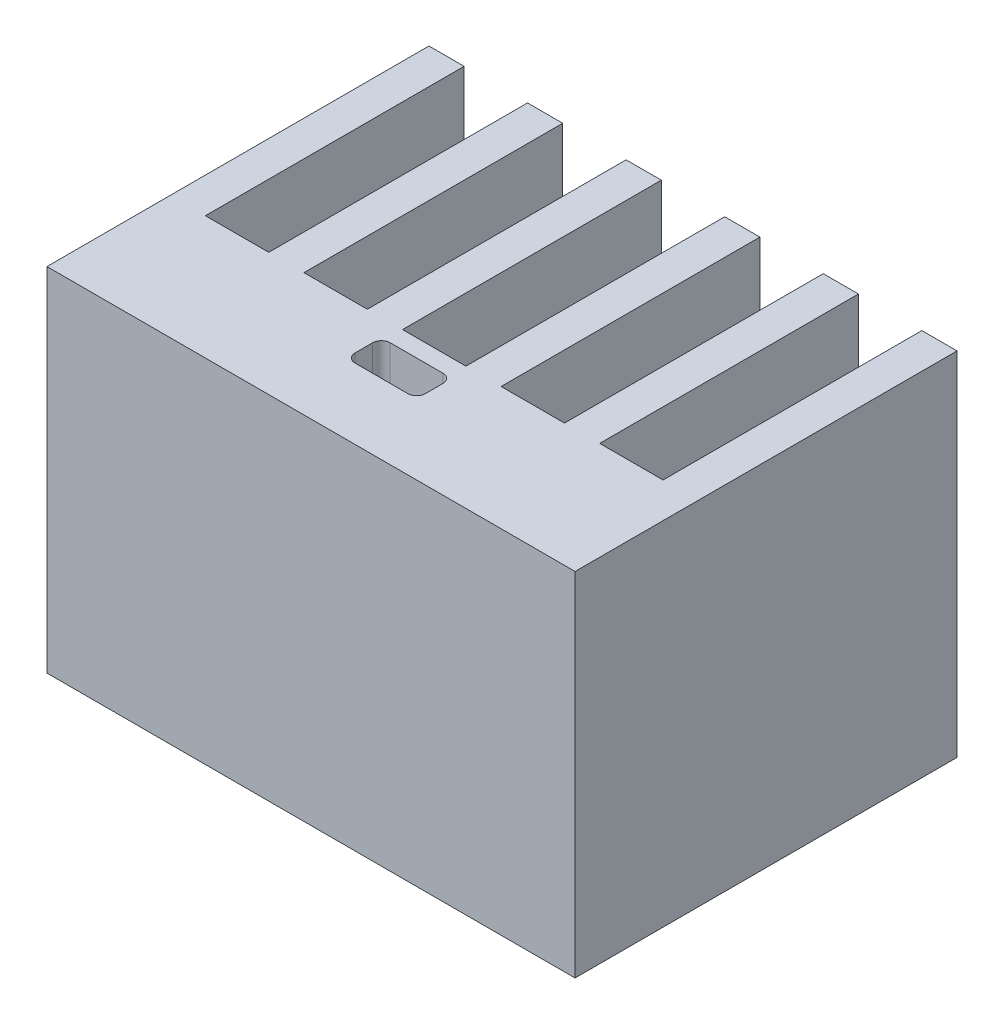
ISO-10303-21;
HEADER;
FILE_DESCRIPTION(('STEP AP214'),'2;1');
FILE_NAME('part.step','',(''),(''),'','','');
FILE_SCHEMA(('AUTOMOTIVE_DESIGN { 1 0 10303 214 1 1 1 1 }'));
ENDSEC;
DATA;
#1=APPLICATION_CONTEXT('core data for automotive mechanical design processes');
#2=APPLICATION_PROTOCOL_DEFINITION('international standard','automotive_design',2000,#1);
#3=PRODUCT_CONTEXT('',#1,'mechanical');
#4=PRODUCT('Part','Part','',(#3));
#5=PRODUCT_RELATED_PRODUCT_CATEGORY('part','',(#4));
#6=PRODUCT_DEFINITION_FORMATION('','',#4);
#7=PRODUCT_DEFINITION_CONTEXT('part definition',#1,'design');
#8=PRODUCT_DEFINITION('design','',#6,#7);
#9=PRODUCT_DEFINITION_SHAPE('','',#8);
#10=(LENGTH_UNIT() NAMED_UNIT(*) SI_UNIT(.MILLI.,.METRE.));
#11=(NAMED_UNIT(*) PLANE_ANGLE_UNIT() SI_UNIT($,.RADIAN.));
#12=(NAMED_UNIT(*) SI_UNIT($,.STERADIAN.) SOLID_ANGLE_UNIT());
#13=UNCERTAINTY_MEASURE_WITH_UNIT(LENGTH_MEASURE(1.E-05),#10,'distance_accuracy_value','');
#14=(GEOMETRIC_REPRESENTATION_CONTEXT(3) GLOBAL_UNCERTAINTY_ASSIGNED_CONTEXT((#13)) GLOBAL_UNIT_ASSIGNED_CONTEXT((#10,
#11,#12)) REPRESENTATION_CONTEXT('',''));
#15=CARTESIAN_POINT('',(0.,0.,0.));
#16=DIRECTION('',(0.,0.,1.));
#17=DIRECTION('',(1.,0.,0.));
#18=AXIS2_PLACEMENT_3D('',#15,#16,#17);
#19=CARTESIAN_POINT('',(0.,0.,0.));
#20=DIRECTION('',(0.,0.,1.));
#21=DIRECTION('',(1.,0.,0.));
#22=AXIS2_PLACEMENT_3D('',#19,#20,#21);
#23=PLANE('',#22);
#24=DIRECTION('',(0.,-1.,0.));
#25=VECTOR('',#24,1.);
#26=CARTESIAN_POINT('',(-13.,10.,0.));
#27=LINE('',#26,#25);
#28=CARTESIAN_POINT('',(-13.,10.,0.));
#29=VERTEX_POINT('',#28);
#30=CARTESIAN_POINT('',(-13.,-10.,0.));
#31=VERTEX_POINT('',#30);
#32=EDGE_CURVE('E272',#29,#31,#27,.T.);
#33=ORIENTED_EDGE('',*,*,#32,.F.);
#34=DIRECTION('',(-1.,0.,0.));
#35=VECTOR('',#34,1.);
#36=CARTESIAN_POINT('',(15.,10.,0.));
#37=LINE('',#36,#35);
#38=CARTESIAN_POINT('',(-9.4,10.,0.));
#39=VERTEX_POINT('',#38);
#40=EDGE_CURVE('E277',#39,#29,#37,.T.);
#41=ORIENTED_EDGE('',*,*,#40,.F.);
#42=DIRECTION('',(0.,1.,0.));
#43=VECTOR('',#42,1.);
#44=CARTESIAN_POINT('',(-9.4,10.,0.));
#45=LINE('',#44,#43);
#46=CARTESIAN_POINT('',(-9.40000000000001,-10.,0.));
#47=VERTEX_POINT('',#46);
#48=EDGE_CURVE('E283',#47,#39,#45,.T.);
#49=ORIENTED_EDGE('',*,*,#48,.F.);
#50=DIRECTION('',(1.,0.,0.));
#51=VECTOR('',#50,1.);
#52=CARTESIAN_POINT('',(15.,-10.,0.));
#53=LINE('',#52,#51);
#54=EDGE_CURVE('E462',#31,#47,#53,.T.);
#55=ORIENTED_EDGE('',*,*,#54,.F.);
#56=EDGE_LOOP('',(#33,#41,#49,#55));
#57=FACE_BOUND('',#56,.T.);
#58=ADVANCED_FACE('F39',(#57),#23,.F.);
#59=DIRECTION('',(0.,-1.,0.));
#60=VECTOR('',#59,1.);
#61=CARTESIAN_POINT('',(-7.4,10.,0.));
#62=LINE('',#61,#60);
#63=CARTESIAN_POINT('',(-7.4,10.,0.));
#64=VERTEX_POINT('',#63);
#65=CARTESIAN_POINT('',(-7.4,-10.,0.));
#66=VERTEX_POINT('',#65);
#67=EDGE_CURVE('E279',#64,#66,#62,.T.);
#68=ORIENTED_EDGE('',*,*,#67,.F.);
#69=CARTESIAN_POINT('',(-3.80000000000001,10.,0.));
#70=VERTEX_POINT('',#69);
#71=EDGE_CURVE('E623',#70,#64,#37,.T.);
#72=ORIENTED_EDGE('',*,*,#71,.F.);
#73=DIRECTION('',(0.,1.,0.));
#74=VECTOR('',#73,1.);
#75=CARTESIAN_POINT('',(-3.8,10.,0.));
#76=LINE('',#75,#74);
#77=CARTESIAN_POINT('',(-3.80000000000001,-10.,0.));
#78=VERTEX_POINT('',#77);
#79=EDGE_CURVE('E324',#78,#70,#76,.T.);
#80=ORIENTED_EDGE('',*,*,#79,.F.);
#81=EDGE_CURVE('E465',#66,#78,#53,.T.);
#82=ORIENTED_EDGE('',*,*,#81,.F.);
#83=EDGE_LOOP('',(#68,#72,#80,#82));
#84=FACE_BOUND('',#83,.T.);
#85=ADVANCED_FACE('F670',(#84),#23,.F.);
#86=DIRECTION('',(0.,-1.,0.));
#87=VECTOR('',#86,1.);
#88=CARTESIAN_POINT('',(-1.8,10.,0.));
#89=LINE('',#88,#87);
#90=CARTESIAN_POINT('',(-1.8,10.,0.));
#91=VERTEX_POINT('',#90);
#92=CARTESIAN_POINT('',(-1.8,-10.,0.));
#93=VERTEX_POINT('',#92);
#94=EDGE_CURVE('E318',#91,#93,#89,.T.);
#95=ORIENTED_EDGE('',*,*,#94,.F.);
#96=CARTESIAN_POINT('',(1.79999999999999,10.,0.));
#97=VERTEX_POINT('',#96);
#98=EDGE_CURVE('E620',#97,#91,#37,.T.);
#99=ORIENTED_EDGE('',*,*,#98,.F.);
#100=DIRECTION('',(0.,1.,0.));
#101=VECTOR('',#100,1.);
#102=CARTESIAN_POINT('',(1.8,10.,0.));
#103=LINE('',#102,#101);
#104=CARTESIAN_POINT('',(1.79999999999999,-10.,0.));
#105=VERTEX_POINT('',#104);
#106=EDGE_CURVE('E358',#105,#97,#103,.T.);
#107=ORIENTED_EDGE('',*,*,#106,.F.);
#108=EDGE_CURVE('E633',#93,#105,#53,.T.);
#109=ORIENTED_EDGE('',*,*,#108,.F.);
#110=EDGE_LOOP('',(#95,#99,#107,#109));
#111=FACE_BOUND('',#110,.T.);
#112=ADVANCED_FACE('F653',(#111),#23,.F.);
#113=DIRECTION('',(0.,-1.,0.));
#114=VECTOR('',#113,1.);
#115=CARTESIAN_POINT('',(3.8,10.,0.));
#116=LINE('',#115,#114);
#117=CARTESIAN_POINT('',(3.8,10.,0.));
#118=VERTEX_POINT('',#117);
#119=CARTESIAN_POINT('',(3.8,-10.,0.));
#120=VERTEX_POINT('',#119);
#121=EDGE_CURVE('E352',#118,#120,#116,.T.);
#122=ORIENTED_EDGE('',*,*,#121,.F.);
#123=CARTESIAN_POINT('',(7.4,10.,0.));
#124=VERTEX_POINT('',#123);
#125=EDGE_CURVE('E469',#124,#118,#37,.T.);
#126=ORIENTED_EDGE('',*,*,#125,.F.);
#127=DIRECTION('',(0.,1.,0.));
#128=VECTOR('',#127,1.);
#129=CARTESIAN_POINT('',(7.4,10.,0.));
#130=LINE('',#129,#128);
#131=CARTESIAN_POINT('',(7.4,-10.,0.));
#132=VERTEX_POINT('',#131);
#133=EDGE_CURVE('E392',#132,#124,#130,.T.);
#134=ORIENTED_EDGE('',*,*,#133,.F.);
#135=EDGE_CURVE('E635',#120,#132,#53,.T.);
#136=ORIENTED_EDGE('',*,*,#135,.F.);
#137=EDGE_LOOP('',(#122,#126,#134,#136));
#138=FACE_BOUND('',#137,.T.);
#139=ADVANCED_FACE('F618',(#138),#23,.F.);
#140=DIRECTION('',(0.,-1.,0.));
#141=VECTOR('',#140,1.);
#142=CARTESIAN_POINT('',(9.4,10.,0.));
#143=LINE('',#142,#141);
#144=CARTESIAN_POINT('',(9.4,10.,0.));
#145=VERTEX_POINT('',#144);
#146=CARTESIAN_POINT('',(9.4,-10.,0.));
#147=VERTEX_POINT('',#146);
#148=EDGE_CURVE('E386',#145,#147,#143,.T.);
#149=ORIENTED_EDGE('',*,*,#148,.F.);
#150=CARTESIAN_POINT('',(13.,10.,0.));
#151=VERTEX_POINT('',#150);
#152=EDGE_CURVE('E452',#151,#145,#37,.T.);
#153=ORIENTED_EDGE('',*,*,#152,.F.);
#154=DIRECTION('',(0.,1.,0.));
#155=VECTOR('',#154,1.);
#156=CARTESIAN_POINT('',(13.,10.,0.));
#157=LINE('',#156,#155);
#158=CARTESIAN_POINT('',(13.,-10.,0.));
#159=VERTEX_POINT('',#158);
#160=EDGE_CURVE('E420',#159,#151,#157,.T.);
#161=ORIENTED_EDGE('',*,*,#160,.F.);
#162=EDGE_CURVE('E446',#147,#159,#53,.T.);
#163=ORIENTED_EDGE('',*,*,#162,.F.);
#164=EDGE_LOOP('',(#149,#153,#161,#163));
#165=FACE_BOUND('',#164,.T.);
#166=ADVANCED_FACE('F598',(#165),#23,.F.);
#167=CARTESIAN_POINT('',(-15.,-10.,7.));
#168=DIRECTION('',(1.,0.,0.));
#169=DIRECTION('',(0.,0.,-1.));
#170=AXIS2_PLACEMENT_3D('',#167,#168,#169);
#171=PLANE('',#170);
#172=DIRECTION('',(0.,0.,-1.));
#173=VECTOR('',#172,1.);
#174=CARTESIAN_POINT('',(-15.,10.,7.));
#175=LINE('',#174,#173);
#176=CARTESIAN_POINT('',(-15.,10.,7.));
#177=VERTEX_POINT('',#176);
#178=CARTESIAN_POINT('',(-15.,10.,-14.7));
#179=VERTEX_POINT('',#178);
#180=EDGE_CURVE('E461',#177,#179,#175,.T.);
#181=ORIENTED_EDGE('',*,*,#180,.T.);
#182=DIRECTION('',(0.,1.,0.));
#183=VECTOR('',#182,1.);
#184=CARTESIAN_POINT('',(-15.,10.,-14.7));
#185=LINE('',#184,#183);
#186=CARTESIAN_POINT('',(-15.,-10.,-14.7));
#187=VERTEX_POINT('',#186);
#188=EDGE_CURVE('E268',#187,#179,#185,.T.);
#189=ORIENTED_EDGE('',*,*,#188,.F.);
#190=DIRECTION('',(0.,0.,-1.));
#191=VECTOR('',#190,1.);
#192=CARTESIAN_POINT('',(-15.,-10.,7.));
#193=LINE('',#192,#191);
#194=CARTESIAN_POINT('',(-15.,-10.,7.));
#195=VERTEX_POINT('',#194);
#196=EDGE_CURVE('E478',#195,#187,#193,.T.);
#197=ORIENTED_EDGE('',*,*,#196,.F.);
#198=DIRECTION('',(0.,-1.,0.));
#199=VECTOR('',#198,1.);
#200=CARTESIAN_POINT('',(-15.,-10.,7.));
#201=LINE('',#200,#199);
#202=EDGE_CURVE('E447',#177,#195,#201,.T.);
#203=ORIENTED_EDGE('',*,*,#202,.F.);
#204=EDGE_LOOP('',(#181,#189,#197,#203));
#205=FACE_BOUND('',#204,.T.);
#206=ADVANCED_FACE('F573',(#205),#171,.F.);
#207=CARTESIAN_POINT('',(15.,-10.,7.));
#208=DIRECTION('',(0.,1.,0.));
#209=DIRECTION('',(-1.,0.,0.));
#210=AXIS2_PLACEMENT_3D('',#207,#208,#209);
#211=PLANE('',#210);
#212=DIRECTION('',(0.,0.,-1.));
#213=VECTOR('',#212,1.);
#214=CARTESIAN_POINT('',(2.,-10.,1.));
#215=LINE('',#214,#213);
#216=CARTESIAN_POINT('',(2.,-10.,2.5));
#217=VERTEX_POINT('',#216);
#218=CARTESIAN_POINT('',(2.,-10.,1.5));
#219=VERTEX_POINT('',#218);
#220=EDGE_CURVE('E546',#217,#219,#215,.T.);
#221=ORIENTED_EDGE('',*,*,#220,.T.);
#222=CARTESIAN_POINT('',(1.5,-10.,1.5));
#223=DIRECTION('',(0.,1.,0.));
#224=DIRECTION('',(-1.,0.,0.));
#225=AXIS2_PLACEMENT_3D('',#222,#223,#224);
#226=CIRCLE('',#225,0.5);
#227=CARTESIAN_POINT('',(1.5,-10.,1.));
#228=VERTEX_POINT('',#227);
#229=EDGE_CURVE('E11',#219,#228,#226,.T.);
#230=ORIENTED_EDGE('',*,*,#229,.T.);
#231=DIRECTION('',(-1.,0.,0.));
#232=VECTOR('',#231,1.);
#233=CARTESIAN_POINT('',(-2.,-10.,1.));
#234=LINE('',#233,#232);
#235=CARTESIAN_POINT('',(-1.5,-10.,1.));
#236=VERTEX_POINT('',#235);
#237=EDGE_CURVE('E544',#228,#236,#234,.T.);
#238=ORIENTED_EDGE('',*,*,#237,.T.);
#239=CARTESIAN_POINT('',(-1.5,-10.,1.5));
#240=DIRECTION('',(0.,1.,0.));
#241=DIRECTION('',(-1.,0.,0.));
#242=AXIS2_PLACEMENT_3D('',#239,#240,#241);
#243=CIRCLE('',#242,0.5);
#244=CARTESIAN_POINT('',(-2.,-10.,1.5));
#245=VERTEX_POINT('',#244);
#246=EDGE_CURVE('E517',#236,#245,#243,.T.);
#247=ORIENTED_EDGE('',*,*,#246,.T.);
#248=DIRECTION('',(0.,0.,1.));
#249=VECTOR('',#248,1.);
#250=CARTESIAN_POINT('',(-2.,-10.,1.));
#251=LINE('',#250,#249);
#252=CARTESIAN_POINT('',(-2.,-10.,2.5));
#253=VERTEX_POINT('',#252);
#254=EDGE_CURVE('E566',#245,#253,#251,.T.);
#255=ORIENTED_EDGE('',*,*,#254,.T.);
#256=CARTESIAN_POINT('',(-1.5,-10.,2.5));
#257=DIRECTION('',(0.,1.,0.));
#258=DIRECTION('',(-1.,0.,0.));
#259=AXIS2_PLACEMENT_3D('',#256,#257,#258);
#260=CIRCLE('',#259,0.5);
#261=CARTESIAN_POINT('',(-1.5,-10.,3.));
#262=VERTEX_POINT('',#261);
#263=EDGE_CURVE('E511',#253,#262,#260,.T.);
#264=ORIENTED_EDGE('',*,*,#263,.T.);
#265=DIRECTION('',(1.,0.,0.));
#266=VECTOR('',#265,1.);
#267=CARTESIAN_POINT('',(-2.,-10.,3.));
#268=LINE('',#267,#266);
#269=CARTESIAN_POINT('',(1.5,-10.,3.));
#270=VERTEX_POINT('',#269);
#271=EDGE_CURVE('E554',#262,#270,#268,.T.);
#272=ORIENTED_EDGE('',*,*,#271,.T.);
#273=CARTESIAN_POINT('',(1.5,-10.,2.5));
#274=DIRECTION('',(0.,1.,0.));
#275=DIRECTION('',(-1.,0.,0.));
#276=AXIS2_PLACEMENT_3D('',#273,#274,#275);
#277=CIRCLE('',#276,0.5);
#278=EDGE_CURVE('E62',#270,#217,#277,.T.);
#279=ORIENTED_EDGE('',*,*,#278,.T.);
#280=EDGE_LOOP('',(#221,#230,#238,#247,#255,#264,#272,#279));
#281=FACE_BOUND('',#280,.T.);
#282=ORIENTED_EDGE('',*,*,#196,.T.);
#283=DIRECTION('',(-1.,0.,0.));
#284=VECTOR('',#283,1.);
#285=CARTESIAN_POINT('',(-13.,-10.,-14.7));
#286=LINE('',#285,#284);
#287=CARTESIAN_POINT('',(-13.,-10.,-14.7));
#288=VERTEX_POINT('',#287);
#289=EDGE_CURVE('E261',#288,#187,#286,.T.);
#290=ORIENTED_EDGE('',*,*,#289,.F.);
#291=DIRECTION('',(0.,0.,1.));
#292=VECTOR('',#291,1.);
#293=CARTESIAN_POINT('',(-13.,-10.,-14.7));
#294=LINE('',#293,#292);
#295=EDGE_CURVE('E256',#288,#31,#294,.T.);
#296=ORIENTED_EDGE('',*,*,#295,.T.);
#297=ORIENTED_EDGE('',*,*,#54,.T.);
#298=DIRECTION('',(0.,0.,1.));
#299=VECTOR('',#298,1.);
#300=CARTESIAN_POINT('',(-9.40000000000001,-10.,-14.7));
#301=LINE('',#300,#299);
#302=CARTESIAN_POINT('',(-9.40000000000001,-10.,-14.7));
#303=VERTEX_POINT('',#302);
#304=EDGE_CURVE('E307',#303,#47,#301,.T.);
#305=ORIENTED_EDGE('',*,*,#304,.F.);
#306=DIRECTION('',(-1.,0.,0.));
#307=VECTOR('',#306,1.);
#308=CARTESIAN_POINT('',(-7.4,-10.,-14.7));
#309=LINE('',#308,#307);
#310=CARTESIAN_POINT('',(-7.4,-10.,-14.7));
#311=VERTEX_POINT('',#310);
#312=EDGE_CURVE('E295',#311,#303,#309,.T.);
#313=ORIENTED_EDGE('',*,*,#312,.F.);
#314=DIRECTION('',(0.,0.,1.));
#315=VECTOR('',#314,1.);
#316=CARTESIAN_POINT('',(-7.4,-10.,-14.7));
#317=LINE('',#316,#315);
#318=EDGE_CURVE('E311',#311,#66,#317,.T.);
#319=ORIENTED_EDGE('',*,*,#318,.T.);
#320=ORIENTED_EDGE('',*,*,#81,.T.);
#321=DIRECTION('',(0.,0.,1.));
#322=VECTOR('',#321,1.);
#323=CARTESIAN_POINT('',(-3.80000000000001,-10.,-14.7));
#324=LINE('',#323,#322);
#325=CARTESIAN_POINT('',(-3.80000000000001,-10.,-14.7));
#326=VERTEX_POINT('',#325);
#327=EDGE_CURVE('E341',#326,#78,#324,.T.);
#328=ORIENTED_EDGE('',*,*,#327,.F.);
#329=DIRECTION('',(-1.,0.,0.));
#330=VECTOR('',#329,1.);
#331=CARTESIAN_POINT('',(-1.8,-10.,-14.7));
#332=LINE('',#331,#330);
#333=CARTESIAN_POINT('',(-1.8,-10.,-14.7));
#334=VERTEX_POINT('',#333);
#335=EDGE_CURVE('E327',#334,#326,#332,.T.);
#336=ORIENTED_EDGE('',*,*,#335,.F.);
#337=DIRECTION('',(0.,0.,1.));
#338=VECTOR('',#337,1.);
#339=CARTESIAN_POINT('',(-1.8,-10.,-14.7));
#340=LINE('',#339,#338);
#341=EDGE_CURVE('E345',#334,#93,#340,.T.);
#342=ORIENTED_EDGE('',*,*,#341,.T.);
#343=ORIENTED_EDGE('',*,*,#108,.T.);
#344=DIRECTION('',(0.,0.,1.));
#345=VECTOR('',#344,1.);
#346=CARTESIAN_POINT('',(1.79999999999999,-10.,-14.7));
#347=LINE('',#346,#345);
#348=CARTESIAN_POINT('',(1.79999999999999,-10.,-14.7));
#349=VERTEX_POINT('',#348);
#350=EDGE_CURVE('E375',#349,#105,#347,.T.);
#351=ORIENTED_EDGE('',*,*,#350,.F.);
#352=DIRECTION('',(-1.,0.,0.));
#353=VECTOR('',#352,1.);
#354=CARTESIAN_POINT('',(3.8,-10.,-14.7));
#355=LINE('',#354,#353);
#356=CARTESIAN_POINT('',(3.8,-10.,-14.7));
#357=VERTEX_POINT('',#356);
#358=EDGE_CURVE('E361',#357,#349,#355,.T.);
#359=ORIENTED_EDGE('',*,*,#358,.F.);
#360=DIRECTION('',(0.,0.,1.));
#361=VECTOR('',#360,1.);
#362=CARTESIAN_POINT('',(3.8,-10.,-14.7));
#363=LINE('',#362,#361);
#364=EDGE_CURVE('E379',#357,#120,#363,.T.);
#365=ORIENTED_EDGE('',*,*,#364,.T.);
#366=ORIENTED_EDGE('',*,*,#135,.T.);
#367=DIRECTION('',(0.,0.,1.));
#368=VECTOR('',#367,1.);
#369=CARTESIAN_POINT('',(7.4,-10.,-14.7));
#370=LINE('',#369,#368);
#371=CARTESIAN_POINT('',(7.4,-10.,-14.7));
#372=VERTEX_POINT('',#371);
#373=EDGE_CURVE('E409',#372,#132,#370,.T.);
#374=ORIENTED_EDGE('',*,*,#373,.F.);
#375=DIRECTION('',(-1.,0.,0.));
#376=VECTOR('',#375,1.);
#377=CARTESIAN_POINT('',(9.4,-10.,-14.7));
#378=LINE('',#377,#376);
#379=CARTESIAN_POINT('',(9.4,-10.,-14.7));
#380=VERTEX_POINT('',#379);
#381=EDGE_CURVE('E395',#380,#372,#378,.T.);
#382=ORIENTED_EDGE('',*,*,#381,.F.);
#383=DIRECTION('',(0.,0.,1.));
#384=VECTOR('',#383,1.);
#385=CARTESIAN_POINT('',(9.4,-10.,-14.7));
#386=LINE('',#385,#384);
#387=EDGE_CURVE('E413',#380,#147,#386,.T.);
#388=ORIENTED_EDGE('',*,*,#387,.T.);
#389=ORIENTED_EDGE('',*,*,#162,.T.);
#390=DIRECTION('',(0.,0.,1.));
#391=VECTOR('',#390,1.);
#392=CARTESIAN_POINT('',(13.,-10.,-14.7));
#393=LINE('',#392,#391);
#394=CARTESIAN_POINT('',(13.,-10.,-14.7));
#395=VERTEX_POINT('',#394);
#396=EDGE_CURVE('E442',#395,#159,#393,.T.);
#397=ORIENTED_EDGE('',*,*,#396,.F.);
#398=DIRECTION('',(-1.,0.,0.));
#399=VECTOR('',#398,1.);
#400=CARTESIAN_POINT('',(15.,-10.,-14.7));
#401=LINE('',#400,#399);
#402=CARTESIAN_POINT('',(15.,-10.,-14.7));
#403=VERTEX_POINT('',#402);
#404=EDGE_CURVE('E425',#403,#395,#401,.T.);
#405=ORIENTED_EDGE('',*,*,#404,.F.);
#406=DIRECTION('',(0.,0.,-1.));
#407=VECTOR('',#406,1.);
#408=CARTESIAN_POINT('',(15.,-10.,7.));
#409=LINE('',#408,#407);
#410=CARTESIAN_POINT('',(15.,-10.,7.));
#411=VERTEX_POINT('',#410);
#412=EDGE_CURVE('E475',#411,#403,#409,.T.);
#413=ORIENTED_EDGE('',*,*,#412,.F.);
#414=DIRECTION('',(1.,0.,0.));
#415=VECTOR('',#414,1.);
#416=CARTESIAN_POINT('',(15.,-10.,7.));
#417=LINE('',#416,#415);
#418=EDGE_CURVE('E451',#195,#411,#417,.T.);
#419=ORIENTED_EDGE('',*,*,#418,.F.);
#420=EDGE_LOOP('',(#282,#290,#296,#297,#305,#313,#319,#320,#328,#336,#342,#343,#351,#359,#365,
#366,#374,#382,#388,#389,#397,#405,#413,#419));
#421=FACE_BOUND('',#420,.T.);
#422=ADVANCED_FACE('F542',(#281,#421),#211,.F.);
#423=CARTESIAN_POINT('',(15.,-10.,7.));
#424=DIRECTION('',(-1.,0.,0.));
#425=DIRECTION('',(0.,0.,1.));
#426=AXIS2_PLACEMENT_3D('',#423,#424,#425);
#427=PLANE('',#426);
#428=ORIENTED_EDGE('',*,*,#412,.T.);
#429=DIRECTION('',(0.,-1.,0.));
#430=VECTOR('',#429,1.);
#431=CARTESIAN_POINT('',(15.,10.,-14.7));
#432=LINE('',#431,#430);
#433=CARTESIAN_POINT('',(15.,10.,-14.7));
#434=VERTEX_POINT('',#433);
#435=EDGE_CURVE('E421',#434,#403,#432,.T.);
#436=ORIENTED_EDGE('',*,*,#435,.F.);
#437=DIRECTION('',(0.,0.,-1.));
#438=VECTOR('',#437,1.);
#439=CARTESIAN_POINT('',(15.,10.,7.));
#440=LINE('',#439,#438);
#441=CARTESIAN_POINT('',(15.,10.,7.));
#442=VERTEX_POINT('',#441);
#443=EDGE_CURVE('E472',#442,#434,#440,.T.);
#444=ORIENTED_EDGE('',*,*,#443,.F.);
#445=DIRECTION('',(0.,1.,0.));
#446=VECTOR('',#445,1.);
#447=CARTESIAN_POINT('',(15.,-10.,7.));
#448=LINE('',#447,#446);
#449=EDGE_CURVE('E455',#411,#442,#448,.T.);
#450=ORIENTED_EDGE('',*,*,#449,.F.);
#451=EDGE_LOOP('',(#428,#436,#444,#450));
#452=FACE_BOUND('',#451,.T.);
#453=ADVANCED_FACE('F584',(#452),#427,.F.);
#454=CARTESIAN_POINT('',(15.,10.,7.));
#455=DIRECTION('',(0.,-1.,0.));
#456=DIRECTION('',(1.,0.,0.));
#457=AXIS2_PLACEMENT_3D('',#454,#455,#456);
#458=PLANE('',#457);
#459=DIRECTION('',(1.,0.,0.));
#460=VECTOR('',#459,1.);
#461=CARTESIAN_POINT('',(-2.,10.,3.));
#462=LINE('',#461,#460);
#463=CARTESIAN_POINT('',(-1.5,10.,3.));
#464=VERTEX_POINT('',#463);
#465=CARTESIAN_POINT('',(1.5,10.,3.));
#466=VERTEX_POINT('',#465);
#467=EDGE_CURVE('E537',#464,#466,#462,.T.);
#468=ORIENTED_EDGE('',*,*,#467,.F.);
#469=CARTESIAN_POINT('',(-1.5,10.,2.5));
#470=DIRECTION('',(0.,-1.,0.));
#471=DIRECTION('',(1.,0.,0.));
#472=AXIS2_PLACEMENT_3D('',#469,#470,#471);
#473=CIRCLE('',#472,0.5);
#474=CARTESIAN_POINT('',(-2.,10.,2.5));
#475=VERTEX_POINT('',#474);
#476=EDGE_CURVE('E508',#464,#475,#473,.T.);
#477=ORIENTED_EDGE('',*,*,#476,.T.);
#478=DIRECTION('',(0.,0.,1.));
#479=VECTOR('',#478,1.);
#480=CARTESIAN_POINT('',(-2.,10.,1.));
#481=LINE('',#480,#479);
#482=CARTESIAN_POINT('',(-2.,10.,1.5));
#483=VERTEX_POINT('',#482);
#484=EDGE_CURVE('E558',#483,#475,#481,.T.);
#485=ORIENTED_EDGE('',*,*,#484,.F.);
#486=CARTESIAN_POINT('',(-1.5,10.,1.5));
#487=DIRECTION('',(0.,-1.,0.));
#488=DIRECTION('',(1.,0.,0.));
#489=AXIS2_PLACEMENT_3D('',#486,#487,#488);
#490=CIRCLE('',#489,0.5);
#491=CARTESIAN_POINT('',(-1.5,10.,1.));
#492=VERTEX_POINT('',#491);
#493=EDGE_CURVE('E514',#483,#492,#490,.T.);
#494=ORIENTED_EDGE('',*,*,#493,.T.);
#495=DIRECTION('',(-1.,0.,0.));
#496=VECTOR('',#495,1.);
#497=CARTESIAN_POINT('',(-2.,10.,1.));
#498=LINE('',#497,#496);
#499=CARTESIAN_POINT('',(1.5,10.,1.));
#500=VERTEX_POINT('',#499);
#501=EDGE_CURVE('E531',#500,#492,#498,.T.);
#502=ORIENTED_EDGE('',*,*,#501,.F.);
#503=CARTESIAN_POINT('',(1.5,10.,1.5));
#504=DIRECTION('',(0.,-1.,0.));
#505=DIRECTION('',(1.,0.,0.));
#506=AXIS2_PLACEMENT_3D('',#503,#504,#505);
#507=CIRCLE('',#506,0.5);
#508=CARTESIAN_POINT('',(2.,10.,1.5));
#509=VERTEX_POINT('',#508);
#510=EDGE_CURVE('E48',#500,#509,#507,.T.);
#511=ORIENTED_EDGE('',*,*,#510,.T.);
#512=DIRECTION('',(0.,0.,-1.));
#513=VECTOR('',#512,1.);
#514=CARTESIAN_POINT('',(2.,10.,1.));
#515=LINE('',#514,#513);
#516=CARTESIAN_POINT('',(2.,10.,2.5));
#517=VERTEX_POINT('',#516);
#518=EDGE_CURVE('E529',#517,#509,#515,.T.);
#519=ORIENTED_EDGE('',*,*,#518,.F.);
#520=CARTESIAN_POINT('',(1.5,10.,2.5));
#521=DIRECTION('',(0.,-1.,0.));
#522=DIRECTION('',(1.,0.,0.));
#523=AXIS2_PLACEMENT_3D('',#520,#521,#522);
#524=CIRCLE('',#523,0.5);
#525=EDGE_CURVE('E520',#517,#466,#524,.T.);
#526=ORIENTED_EDGE('',*,*,#525,.T.);
#527=EDGE_LOOP('',(#468,#477,#485,#494,#502,#511,#519,#526));
#528=FACE_BOUND('',#527,.T.);
#529=ORIENTED_EDGE('',*,*,#443,.T.);
#530=DIRECTION('',(1.,0.,0.));
#531=VECTOR('',#530,1.);
#532=CARTESIAN_POINT('',(15.,10.,-14.7));
#533=LINE('',#532,#531);
#534=CARTESIAN_POINT('',(13.,10.,-14.7));
#535=VERTEX_POINT('',#534);
#536=EDGE_CURVE('E431',#535,#434,#533,.T.);
#537=ORIENTED_EDGE('',*,*,#536,.F.);
#538=DIRECTION('',(0.,0.,1.));
#539=VECTOR('',#538,1.);
#540=CARTESIAN_POINT('',(13.,10.,-14.7));
#541=LINE('',#540,#539);
#542=EDGE_CURVE('E435',#535,#151,#541,.T.);
#543=ORIENTED_EDGE('',*,*,#542,.T.);
#544=ORIENTED_EDGE('',*,*,#152,.T.);
#545=DIRECTION('',(0.,0.,1.));
#546=VECTOR('',#545,1.);
#547=CARTESIAN_POINT('',(9.4,10.,-14.7));
#548=LINE('',#547,#546);
#549=CARTESIAN_POINT('',(9.4,10.,-14.7));
#550=VERTEX_POINT('',#549);
#551=EDGE_CURVE('E417',#550,#145,#548,.T.);
#552=ORIENTED_EDGE('',*,*,#551,.F.);
#553=DIRECTION('',(1.,0.,0.));
#554=VECTOR('',#553,1.);
#555=CARTESIAN_POINT('',(9.4,10.,-14.7));
#556=LINE('',#555,#554);
#557=CARTESIAN_POINT('',(7.4,10.,-14.7));
#558=VERTEX_POINT('',#557);
#559=EDGE_CURVE('E387',#558,#550,#556,.T.);
#560=ORIENTED_EDGE('',*,*,#559,.F.);
#561=DIRECTION('',(0.,0.,1.));
#562=VECTOR('',#561,1.);
#563=CARTESIAN_POINT('',(7.4,10.,-14.7));
#564=LINE('',#563,#562);
#565=EDGE_CURVE('E401',#558,#124,#564,.T.);
#566=ORIENTED_EDGE('',*,*,#565,.T.);
#567=ORIENTED_EDGE('',*,*,#125,.T.);
#568=DIRECTION('',(0.,0.,1.));
#569=VECTOR('',#568,1.);
#570=CARTESIAN_POINT('',(3.8,10.,-14.7));
#571=LINE('',#570,#569);
#572=CARTESIAN_POINT('',(3.8,10.,-14.7));
#573=VERTEX_POINT('',#572);
#574=EDGE_CURVE('E383',#573,#118,#571,.T.);
#575=ORIENTED_EDGE('',*,*,#574,.F.);
#576=DIRECTION('',(1.,0.,0.));
#577=VECTOR('',#576,1.);
#578=CARTESIAN_POINT('',(3.8,10.,-14.7));
#579=LINE('',#578,#577);
#580=CARTESIAN_POINT('',(1.8,10.,-14.7));
#581=VERTEX_POINT('',#580);
#582=EDGE_CURVE('E353',#581,#573,#579,.T.);
#583=ORIENTED_EDGE('',*,*,#582,.F.);
#584=DIRECTION('',(0.,0.,1.));
#585=VECTOR('',#584,1.);
#586=CARTESIAN_POINT('',(1.8,10.,-14.7));
#587=LINE('',#586,#585);
#588=EDGE_CURVE('E367',#581,#97,#587,.T.);
#589=ORIENTED_EDGE('',*,*,#588,.T.);
#590=ORIENTED_EDGE('',*,*,#98,.T.);
#591=DIRECTION('',(0.,0.,1.));
#592=VECTOR('',#591,1.);
#593=CARTESIAN_POINT('',(-1.8,10.,-14.7));
#594=LINE('',#593,#592);
#595=CARTESIAN_POINT('',(-1.8,10.,-14.7));
#596=VERTEX_POINT('',#595);
#597=EDGE_CURVE('E349',#596,#91,#594,.T.);
#598=ORIENTED_EDGE('',*,*,#597,.F.);
#599=DIRECTION('',(1.,0.,0.));
#600=VECTOR('',#599,1.);
#601=CARTESIAN_POINT('',(-1.8,10.,-14.7));
#602=LINE('',#601,#600);
#603=CARTESIAN_POINT('',(-3.8,10.,-14.7));
#604=VERTEX_POINT('',#603);
#605=EDGE_CURVE('E319',#604,#596,#602,.T.);
#606=ORIENTED_EDGE('',*,*,#605,.F.);
#607=DIRECTION('',(0.,0.,1.));
#608=VECTOR('',#607,1.);
#609=CARTESIAN_POINT('',(-3.8,10.,-14.7));
#610=LINE('',#609,#608);
#611=EDGE_CURVE('E333',#604,#70,#610,.T.);
#612=ORIENTED_EDGE('',*,*,#611,.T.);
#613=ORIENTED_EDGE('',*,*,#71,.T.);
#614=DIRECTION('',(0.,0.,1.));
#615=VECTOR('',#614,1.);
#616=CARTESIAN_POINT('',(-7.4,10.,-14.7));
#617=LINE('',#616,#615);
#618=CARTESIAN_POINT('',(-7.4,10.,-14.7));
#619=VERTEX_POINT('',#618);
#620=EDGE_CURVE('E315',#619,#64,#617,.T.);
#621=ORIENTED_EDGE('',*,*,#620,.F.);
#622=DIRECTION('',(1.,0.,0.));
#623=VECTOR('',#622,1.);
#624=CARTESIAN_POINT('',(-7.4,10.,-14.7));
#625=LINE('',#624,#623);
#626=CARTESIAN_POINT('',(-9.4,10.,-14.7));
#627=VERTEX_POINT('',#626);
#628=EDGE_CURVE('E288',#627,#619,#625,.T.);
#629=ORIENTED_EDGE('',*,*,#628,.F.);
#630=DIRECTION('',(0.,0.,1.));
#631=VECTOR('',#630,1.);
#632=CARTESIAN_POINT('',(-9.4,10.,-14.7));
#633=LINE('',#632,#631);
#634=EDGE_CURVE('E300',#627,#39,#633,.T.);
#635=ORIENTED_EDGE('',*,*,#634,.T.);
#636=ORIENTED_EDGE('',*,*,#40,.T.);
#637=DIRECTION('',(0.,0.,1.));
#638=VECTOR('',#637,1.);
#639=CARTESIAN_POINT('',(-13.,10.,-14.7));
#640=LINE('',#639,#638);
#641=CARTESIAN_POINT('',(-13.,10.,-14.7));
#642=VERTEX_POINT('',#641);
#643=EDGE_CURVE('E253',#642,#29,#640,.T.);
#644=ORIENTED_EDGE('',*,*,#643,.F.);
#645=DIRECTION('',(1.,0.,0.));
#646=VECTOR('',#645,1.);
#647=CARTESIAN_POINT('',(-13.,10.,-14.7));
#648=LINE('',#647,#646);
#649=EDGE_CURVE('E262',#179,#642,#648,.T.);
#650=ORIENTED_EDGE('',*,*,#649,.F.);
#651=ORIENTED_EDGE('',*,*,#180,.F.);
#652=DIRECTION('',(-1.,0.,0.));
#653=VECTOR('',#652,1.);
#654=CARTESIAN_POINT('',(15.,10.,7.));
#655=LINE('',#654,#653);
#656=EDGE_CURVE('E458',#442,#177,#655,.T.);
#657=ORIENTED_EDGE('',*,*,#656,.F.);
#658=EDGE_LOOP('',(#529,#537,#543,#544,#552,#560,#566,#567,#575,#583,#589,#590,#598,#606,#612,
#613,#621,#629,#635,#636,#644,#650,#651,#657));
#659=FACE_BOUND('',#658,.T.);
#660=ADVANCED_FACE('F275',(#528,#659),#458,.F.);
#661=CARTESIAN_POINT('',(0.,0.,7.));
#662=DIRECTION('',(0.,0.,1.));
#663=DIRECTION('',(1.,0.,0.));
#664=AXIS2_PLACEMENT_3D('',#661,#662,#663);
#665=PLANE('',#664);
#666=ORIENTED_EDGE('',*,*,#202,.T.);
#667=ORIENTED_EDGE('',*,*,#418,.T.);
#668=ORIENTED_EDGE('',*,*,#449,.T.);
#669=ORIENTED_EDGE('',*,*,#656,.T.);
#670=EDGE_LOOP('',(#666,#667,#668,#669));
#671=FACE_BOUND('',#670,.T.);
#672=ADVANCED_FACE('F579',(#671),#665,.T.);
#673=CARTESIAN_POINT('',(13.,10.,-14.7));
#674=DIRECTION('',(1.,0.,0.));
#675=DIRECTION('',(0.,1.,0.));
#676=AXIS2_PLACEMENT_3D('',#673,#674,#675);
#677=PLANE('',#676);
#678=ORIENTED_EDGE('',*,*,#160,.T.);
#679=ORIENTED_EDGE('',*,*,#542,.F.);
#680=DIRECTION('',(0.,1.,0.));
#681=VECTOR('',#680,1.);
#682=CARTESIAN_POINT('',(13.,10.,-14.7));
#683=LINE('',#682,#681);
#684=EDGE_CURVE('E428',#395,#535,#683,.T.);
#685=ORIENTED_EDGE('',*,*,#684,.F.);
#686=ORIENTED_EDGE('',*,*,#396,.T.);
#687=EDGE_LOOP('',(#678,#679,#685,#686));
#688=FACE_BOUND('',#687,.T.);
#689=ADVANCED_FACE('F593',(#688),#677,.F.);
#690=CARTESIAN_POINT('',(0.,0.,-14.7));
#691=DIRECTION('',(0.,0.,-1.));
#692=DIRECTION('',(-1.,0.,0.));
#693=AXIS2_PLACEMENT_3D('',#690,#691,#692);
#694=PLANE('',#693);
#695=ORIENTED_EDGE('',*,*,#435,.T.);
#696=ORIENTED_EDGE('',*,*,#404,.T.);
#697=ORIENTED_EDGE('',*,*,#684,.T.);
#698=ORIENTED_EDGE('',*,*,#536,.T.);
#699=EDGE_LOOP('',(#695,#696,#697,#698));
#700=FACE_BOUND('',#699,.T.);
#701=ADVANCED_FACE('F587',(#700),#694,.T.);
#702=CARTESIAN_POINT('',(9.4,10.,-14.7));
#703=DIRECTION('',(-1.,0.,0.));
#704=DIRECTION('',(0.,0.,1.));
#705=AXIS2_PLACEMENT_3D('',#702,#703,#704);
#706=PLANE('',#705);
#707=ORIENTED_EDGE('',*,*,#148,.T.);
#708=ORIENTED_EDGE('',*,*,#387,.F.);
#709=DIRECTION('',(0.,-1.,0.));
#710=VECTOR('',#709,1.);
#711=CARTESIAN_POINT('',(9.4,10.,-14.7));
#712=LINE('',#711,#710);
#713=EDGE_CURVE('E391',#550,#380,#712,.T.);
#714=ORIENTED_EDGE('',*,*,#713,.F.);
#715=ORIENTED_EDGE('',*,*,#551,.T.);
#716=EDGE_LOOP('',(#707,#708,#714,#715));
#717=FACE_BOUND('',#716,.T.);
#718=ADVANCED_FACE('F601',(#717),#706,.F.);
#719=CARTESIAN_POINT('',(7.4,10.,-14.7));
#720=DIRECTION('',(1.,0.,0.));
#721=DIRECTION('',(0.,1.,0.));
#722=AXIS2_PLACEMENT_3D('',#719,#720,#721);
#723=PLANE('',#722);
#724=ORIENTED_EDGE('',*,*,#133,.T.);
#725=ORIENTED_EDGE('',*,*,#565,.F.);
#726=DIRECTION('',(0.,1.,0.));
#727=VECTOR('',#726,1.);
#728=CARTESIAN_POINT('',(7.4,10.,-14.7));
#729=LINE('',#728,#727);
#730=EDGE_CURVE('E398',#372,#558,#729,.T.);
#731=ORIENTED_EDGE('',*,*,#730,.F.);
#732=ORIENTED_EDGE('',*,*,#373,.T.);
#733=EDGE_LOOP('',(#724,#725,#731,#732));
#734=FACE_BOUND('',#733,.T.);
#735=ADVANCED_FACE('F614',(#734),#723,.F.);
#736=CARTESIAN_POINT('',(0.,0.,-14.7));
#737=DIRECTION('',(0.,0.,1.));
#738=DIRECTION('',(1.,0.,0.));
#739=AXIS2_PLACEMENT_3D('',#736,#737,#738);
#740=PLANE('',#739);
#741=ORIENTED_EDGE('',*,*,#559,.T.);
#742=ORIENTED_EDGE('',*,*,#713,.T.);
#743=ORIENTED_EDGE('',*,*,#381,.T.);
#744=ORIENTED_EDGE('',*,*,#730,.T.);
#745=EDGE_LOOP('',(#741,#742,#743,#744));
#746=FACE_BOUND('',#745,.T.);
#747=ADVANCED_FACE('F606',(#746),#740,.F.);
#748=CARTESIAN_POINT('',(3.8,10.,-14.7));
#749=DIRECTION('',(-1.,0.,0.));
#750=DIRECTION('',(0.,0.,1.));
#751=AXIS2_PLACEMENT_3D('',#748,#749,#750);
#752=PLANE('',#751);
#753=ORIENTED_EDGE('',*,*,#121,.T.);
#754=ORIENTED_EDGE('',*,*,#364,.F.);
#755=DIRECTION('',(0.,-1.,0.));
#756=VECTOR('',#755,1.);
#757=CARTESIAN_POINT('',(3.8,10.,-14.7));
#758=LINE('',#757,#756);
#759=EDGE_CURVE('E357',#573,#357,#758,.T.);
#760=ORIENTED_EDGE('',*,*,#759,.F.);
#761=ORIENTED_EDGE('',*,*,#574,.T.);
#762=EDGE_LOOP('',(#753,#754,#760,#761));
#763=FACE_BOUND('',#762,.T.);
#764=ADVANCED_FACE('F641',(#763),#752,.F.);
#765=CARTESIAN_POINT('',(1.8,10.,-14.7));
#766=DIRECTION('',(1.,0.,0.));
#767=DIRECTION('',(0.,1.,0.));
#768=AXIS2_PLACEMENT_3D('',#765,#766,#767);
#769=PLANE('',#768);
#770=ORIENTED_EDGE('',*,*,#106,.T.);
#771=ORIENTED_EDGE('',*,*,#588,.F.);
#772=DIRECTION('',(0.,1.,0.));
#773=VECTOR('',#772,1.);
#774=CARTESIAN_POINT('',(1.8,10.,-14.7));
#775=LINE('',#774,#773);
#776=EDGE_CURVE('E364',#349,#581,#775,.T.);
#777=ORIENTED_EDGE('',*,*,#776,.F.);
#778=ORIENTED_EDGE('',*,*,#350,.T.);
#779=EDGE_LOOP('',(#770,#771,#777,#778));
#780=FACE_BOUND('',#779,.T.);
#781=ADVANCED_FACE('F648',(#780),#769,.F.);
#782=CARTESIAN_POINT('',(0.,0.,-14.7));
#783=DIRECTION('',(0.,0.,1.));
#784=DIRECTION('',(1.,0.,0.));
#785=AXIS2_PLACEMENT_3D('',#782,#783,#784);
#786=PLANE('',#785);
#787=ORIENTED_EDGE('',*,*,#582,.T.);
#788=ORIENTED_EDGE('',*,*,#759,.T.);
#789=ORIENTED_EDGE('',*,*,#358,.T.);
#790=ORIENTED_EDGE('',*,*,#776,.T.);
#791=EDGE_LOOP('',(#787,#788,#789,#790));
#792=FACE_BOUND('',#791,.T.);
#793=ADVANCED_FACE('F645',(#792),#786,.F.);
#794=CARTESIAN_POINT('',(-1.8,10.,-14.7));
#795=DIRECTION('',(-1.,0.,0.));
#796=DIRECTION('',(0.,0.,1.));
#797=AXIS2_PLACEMENT_3D('',#794,#795,#796);
#798=PLANE('',#797);
#799=ORIENTED_EDGE('',*,*,#94,.T.);
#800=ORIENTED_EDGE('',*,*,#341,.F.);
#801=DIRECTION('',(0.,-1.,0.));
#802=VECTOR('',#801,1.);
#803=CARTESIAN_POINT('',(-1.8,10.,-14.7));
#804=LINE('',#803,#802);
#805=EDGE_CURVE('E323',#596,#334,#804,.T.);
#806=ORIENTED_EDGE('',*,*,#805,.F.);
#807=ORIENTED_EDGE('',*,*,#597,.T.);
#808=EDGE_LOOP('',(#799,#800,#806,#807));
#809=FACE_BOUND('',#808,.T.);
#810=ADVANCED_FACE('F656',(#809),#798,.F.);
#811=CARTESIAN_POINT('',(-3.8,10.,-14.7));
#812=DIRECTION('',(1.,0.,0.));
#813=DIRECTION('',(0.,1.,0.));
#814=AXIS2_PLACEMENT_3D('',#811,#812,#813);
#815=PLANE('',#814);
#816=ORIENTED_EDGE('',*,*,#79,.T.);
#817=ORIENTED_EDGE('',*,*,#611,.F.);
#818=DIRECTION('',(0.,1.,0.));
#819=VECTOR('',#818,1.);
#820=CARTESIAN_POINT('',(-3.8,10.,-14.7));
#821=LINE('',#820,#819);
#822=EDGE_CURVE('E330',#326,#604,#821,.T.);
#823=ORIENTED_EDGE('',*,*,#822,.F.);
#824=ORIENTED_EDGE('',*,*,#327,.T.);
#825=EDGE_LOOP('',(#816,#817,#823,#824));
#826=FACE_BOUND('',#825,.T.);
#827=ADVANCED_FACE('F666',(#826),#815,.F.);
#828=CARTESIAN_POINT('',(0.,0.,-14.7));
#829=DIRECTION('',(0.,0.,1.));
#830=DIRECTION('',(1.,0.,0.));
#831=AXIS2_PLACEMENT_3D('',#828,#829,#830);
#832=PLANE('',#831);
#833=ORIENTED_EDGE('',*,*,#605,.T.);
#834=ORIENTED_EDGE('',*,*,#805,.T.);
#835=ORIENTED_EDGE('',*,*,#335,.T.);
#836=ORIENTED_EDGE('',*,*,#822,.T.);
#837=EDGE_LOOP('',(#833,#834,#835,#836));
#838=FACE_BOUND('',#837,.T.);
#839=ADVANCED_FACE('F661',(#838),#832,.F.);
#840=CARTESIAN_POINT('',(-7.4,10.,-14.7));
#841=DIRECTION('',(-1.,0.,0.));
#842=DIRECTION('',(0.,0.,1.));
#843=AXIS2_PLACEMENT_3D('',#840,#841,#842);
#844=PLANE('',#843);
#845=ORIENTED_EDGE('',*,*,#67,.T.);
#846=ORIENTED_EDGE('',*,*,#318,.F.);
#847=DIRECTION('',(0.,-1.,0.));
#848=VECTOR('',#847,1.);
#849=CARTESIAN_POINT('',(-7.4,10.,-14.7));
#850=LINE('',#849,#848);
#851=EDGE_CURVE('E292',#619,#311,#850,.T.);
#852=ORIENTED_EDGE('',*,*,#851,.F.);
#853=ORIENTED_EDGE('',*,*,#620,.T.);
#854=EDGE_LOOP('',(#845,#846,#852,#853));
#855=FACE_BOUND('',#854,.T.);
#856=ADVANCED_FACE('F673',(#855),#844,.F.);
#857=CARTESIAN_POINT('',(-9.4,10.,-14.7));
#858=DIRECTION('',(1.,0.,0.));
#859=DIRECTION('',(0.,1.,0.));
#860=AXIS2_PLACEMENT_3D('',#857,#858,#859);
#861=PLANE('',#860);
#862=ORIENTED_EDGE('',*,*,#48,.T.);
#863=ORIENTED_EDGE('',*,*,#634,.F.);
#864=DIRECTION('',(0.,1.,0.));
#865=VECTOR('',#864,1.);
#866=CARTESIAN_POINT('',(-9.4,10.,-14.7));
#867=LINE('',#866,#865);
#868=EDGE_CURVE('E298',#303,#627,#867,.T.);
#869=ORIENTED_EDGE('',*,*,#868,.F.);
#870=ORIENTED_EDGE('',*,*,#304,.T.);
#871=EDGE_LOOP('',(#862,#863,#869,#870));
#872=FACE_BOUND('',#871,.T.);
#873=ADVANCED_FACE('F683',(#872),#861,.F.);
#874=CARTESIAN_POINT('',(0.,0.,-14.7));
#875=DIRECTION('',(0.,0.,1.));
#876=DIRECTION('',(1.,0.,0.));
#877=AXIS2_PLACEMENT_3D('',#874,#875,#876);
#878=PLANE('',#877);
#879=ORIENTED_EDGE('',*,*,#628,.T.);
#880=ORIENTED_EDGE('',*,*,#851,.T.);
#881=ORIENTED_EDGE('',*,*,#312,.T.);
#882=ORIENTED_EDGE('',*,*,#868,.T.);
#883=EDGE_LOOP('',(#879,#880,#881,#882));
#884=FACE_BOUND('',#883,.T.);
#885=ADVANCED_FACE('F678',(#884),#878,.F.);
#886=CARTESIAN_POINT('',(-13.,10.,-14.7));
#887=DIRECTION('',(-1.,0.,0.));
#888=DIRECTION('',(0.,0.,1.));
#889=AXIS2_PLACEMENT_3D('',#886,#887,#888);
#890=PLANE('',#889);
#891=ORIENTED_EDGE('',*,*,#32,.T.);
#892=ORIENTED_EDGE('',*,*,#295,.F.);
#893=DIRECTION('',(0.,-1.,0.));
#894=VECTOR('',#893,1.);
#895=CARTESIAN_POINT('',(-13.,10.,-14.7));
#896=LINE('',#895,#894);
#897=EDGE_CURVE('E249',#642,#288,#896,.T.);
#898=ORIENTED_EDGE('',*,*,#897,.F.);
#899=ORIENTED_EDGE('',*,*,#643,.T.);
#900=EDGE_LOOP('',(#891,#892,#898,#899));
#901=FACE_BOUND('',#900,.T.);
#902=ADVANCED_FACE('F251',(#901),#890,.F.);
#903=CARTESIAN_POINT('',(0.,0.,-14.7));
#904=DIRECTION('',(0.,0.,1.));
#905=DIRECTION('',(1.,0.,0.));
#906=AXIS2_PLACEMENT_3D('',#903,#904,#905);
#907=PLANE('',#906);
#908=ORIENTED_EDGE('',*,*,#649,.T.);
#909=ORIENTED_EDGE('',*,*,#897,.T.);
#910=ORIENTED_EDGE('',*,*,#289,.T.);
#911=ORIENTED_EDGE('',*,*,#188,.T.);
#912=EDGE_LOOP('',(#908,#909,#910,#911));
#913=FACE_BOUND('',#912,.T.);
#914=ADVANCED_FACE('F266',(#913),#907,.F.);
#915=CARTESIAN_POINT('',(-2.,-10.,1.));
#916=DIRECTION('',(-1.,0.,0.));
#917=DIRECTION('',(0.,0.,1.));
#918=AXIS2_PLACEMENT_3D('',#915,#916,#917);
#919=PLANE('',#918);
#920=ORIENTED_EDGE('',*,*,#484,.T.);
#921=DIRECTION('',(0.,1.,0.));
#922=VECTOR('',#921,1.);
#923=CARTESIAN_POINT('',(-2.,-10.,2.5));
#924=LINE('',#923,#922);
#925=EDGE_CURVE('E492',#475,#253,#924,.F.);
#926=ORIENTED_EDGE('',*,*,#925,.T.);
#927=ORIENTED_EDGE('',*,*,#254,.F.);
#928=DIRECTION('',(0.,1.,0.));
#929=VECTOR('',#928,1.);
#930=CARTESIAN_POINT('',(-2.,10.,1.5));
#931=LINE('',#930,#929);
#932=EDGE_CURVE('E488',#245,#483,#931,.T.);
#933=ORIENTED_EDGE('',*,*,#932,.T.);
#934=EDGE_LOOP('',(#920,#926,#927,#933));
#935=FACE_BOUND('',#934,.T.);
#936=ADVANCED_FACE('F826',(#935),#919,.F.);
#937=CARTESIAN_POINT('',(-2.,-10.,1.));
#938=DIRECTION('',(0.,0.,-1.));
#939=DIRECTION('',(-1.,0.,0.));
#940=AXIS2_PLACEMENT_3D('',#937,#938,#939);
#941=PLANE('',#940);
#942=ORIENTED_EDGE('',*,*,#501,.T.);
#943=DIRECTION('',(0.,1.,0.));
#944=VECTOR('',#943,1.);
#945=CARTESIAN_POINT('',(-1.5,-10.,1.));
#946=LINE('',#945,#944);
#947=EDGE_CURVE('E499',#492,#236,#946,.F.);
#948=ORIENTED_EDGE('',*,*,#947,.T.);
#949=ORIENTED_EDGE('',*,*,#237,.F.);
#950=DIRECTION('',(0.,1.,0.));
#951=VECTOR('',#950,1.);
#952=CARTESIAN_POINT('',(1.5,10.,1.));
#953=LINE('',#952,#951);
#954=EDGE_CURVE('E495',#228,#500,#953,.T.);
#955=ORIENTED_EDGE('',*,*,#954,.T.);
#956=EDGE_LOOP('',(#942,#948,#949,#955));
#957=FACE_BOUND('',#956,.T.);
#958=ADVANCED_FACE('F548',(#957),#941,.F.);
#959=CARTESIAN_POINT('',(2.,-10.,1.));
#960=DIRECTION('',(1.,0.,0.));
#961=DIRECTION('',(0.,0.,-1.));
#962=AXIS2_PLACEMENT_3D('',#959,#960,#961);
#963=PLANE('',#962);
#964=ORIENTED_EDGE('',*,*,#220,.F.);
#965=DIRECTION('',(0.,1.,0.));
#966=VECTOR('',#965,1.);
#967=CARTESIAN_POINT('',(2.,10.,2.5));
#968=LINE('',#967,#966);
#969=EDGE_CURVE('E504',#217,#517,#968,.T.);
#970=ORIENTED_EDGE('',*,*,#969,.T.);
#971=ORIENTED_EDGE('',*,*,#518,.T.);
#972=DIRECTION('',(0.,1.,0.));
#973=VECTOR('',#972,1.);
#974=CARTESIAN_POINT('',(2.,-10.,1.5));
#975=LINE('',#974,#973);
#976=EDGE_CURVE('E55',#509,#219,#975,.F.);
#977=ORIENTED_EDGE('',*,*,#976,.T.);
#978=EDGE_LOOP('',(#964,#970,#971,#977));
#979=FACE_BOUND('',#978,.T.);
#980=ADVANCED_FACE('F534',(#979),#963,.F.);
#981=CARTESIAN_POINT('',(-2.,-10.,3.));
#982=DIRECTION('',(0.,0.,1.));
#983=DIRECTION('',(1.,0.,0.));
#984=AXIS2_PLACEMENT_3D('',#981,#982,#983);
#985=PLANE('',#984);
#986=ORIENTED_EDGE('',*,*,#271,.F.);
#987=DIRECTION('',(0.,1.,0.));
#988=VECTOR('',#987,1.);
#989=CARTESIAN_POINT('',(-1.5,10.,3.));
#990=LINE('',#989,#988);
#991=EDGE_CURVE('E484',#262,#464,#990,.T.);
#992=ORIENTED_EDGE('',*,*,#991,.T.);
#993=ORIENTED_EDGE('',*,*,#467,.T.);
#994=DIRECTION('',(0.,1.,0.));
#995=VECTOR('',#994,1.);
#996=CARTESIAN_POINT('',(1.5,-10.,3.));
#997=LINE('',#996,#995);
#998=EDGE_CURVE('E481',#466,#270,#997,.F.);
#999=ORIENTED_EDGE('',*,*,#998,.T.);
#1000=EDGE_LOOP('',(#986,#992,#993,#999));
#1001=FACE_BOUND('',#1000,.T.);
#1002=ADVANCED_FACE('F847',(#1001),#985,.F.);
#1003=CARTESIAN_POINT('',(-1.5,-10.,2.5));
#1004=DIRECTION('',(0.,-1.,0.));
#1005=DIRECTION('',(1.,0.,0.));
#1006=AXIS2_PLACEMENT_3D('',#1003,#1004,#1005);
#1007=CYLINDRICAL_SURFACE('',#1006,0.5);
#1008=ORIENTED_EDGE('',*,*,#263,.F.);
#1009=ORIENTED_EDGE('',*,*,#925,.F.);
#1010=ORIENTED_EDGE('',*,*,#476,.F.);
#1011=ORIENTED_EDGE('',*,*,#991,.F.);
#1012=EDGE_LOOP('',(#1008,#1009,#1010,#1011));
#1013=FACE_BOUND('',#1012,.T.);
#1014=ADVANCED_FACE('F854',(#1013),#1007,.F.);
#1015=CARTESIAN_POINT('',(-1.5,-10.,1.5));
#1016=DIRECTION('',(0.,-1.,0.));
#1017=DIRECTION('',(1.,0.,0.));
#1018=AXIS2_PLACEMENT_3D('',#1015,#1016,#1017);
#1019=CYLINDRICAL_SURFACE('',#1018,0.5);
#1020=ORIENTED_EDGE('',*,*,#246,.F.);
#1021=ORIENTED_EDGE('',*,*,#947,.F.);
#1022=ORIENTED_EDGE('',*,*,#493,.F.);
#1023=ORIENTED_EDGE('',*,*,#932,.F.);
#1024=EDGE_LOOP('',(#1020,#1021,#1022,#1023));
#1025=FACE_BOUND('',#1024,.T.);
#1026=ADVANCED_FACE('F862',(#1025),#1019,.F.);
#1027=CARTESIAN_POINT('',(1.5,-10.,2.5));
#1028=DIRECTION('',(0.,-1.,0.));
#1029=DIRECTION('',(1.,0.,0.));
#1030=AXIS2_PLACEMENT_3D('',#1027,#1028,#1029);
#1031=CYLINDRICAL_SURFACE('',#1030,0.5);
#1032=ORIENTED_EDGE('',*,*,#278,.F.);
#1033=ORIENTED_EDGE('',*,*,#998,.F.);
#1034=ORIENTED_EDGE('',*,*,#525,.F.);
#1035=ORIENTED_EDGE('',*,*,#969,.F.);
#1036=EDGE_LOOP('',(#1032,#1033,#1034,#1035));
#1037=FACE_BOUND('',#1036,.T.);
#1038=ADVANCED_FACE('F870',(#1037),#1031,.F.);
#1039=CARTESIAN_POINT('',(1.5,-10.,1.5));
#1040=DIRECTION('',(0.,-1.,0.));
#1041=DIRECTION('',(1.,0.,0.));
#1042=AXIS2_PLACEMENT_3D('',#1039,#1040,#1041);
#1043=CYLINDRICAL_SURFACE('',#1042,0.5);
#1044=ORIENTED_EDGE('',*,*,#229,.F.);
#1045=ORIENTED_EDGE('',*,*,#976,.F.);
#1046=ORIENTED_EDGE('',*,*,#510,.F.);
#1047=ORIENTED_EDGE('',*,*,#954,.F.);
#1048=EDGE_LOOP('',(#1044,#1045,#1046,#1047));
#1049=FACE_BOUND('',#1048,.T.);
#1050=ADVANCED_FACE('F41',(#1049),#1043,.F.);
#1051=CLOSED_SHELL('',(#58,#85,#112,#139,#166,#206,#422,#453,#660,#672,#689,#701,#718,#735,#747,
#764,#781,#793,#810,#827,#839,#856,#873,#885,#902,#914,#936,#958,#980,#1002,#1014,#1026,#1038,#1050));
#1052=MANIFOLD_SOLID_BREP('B2',#1051);
#1053=ADVANCED_BREP_SHAPE_REPRESENTATION('',(#18,#1052),#14);
#1054=SHAPE_DEFINITION_REPRESENTATION(#9,#1053);
ENDSEC;
END-ISO-10303-21;
